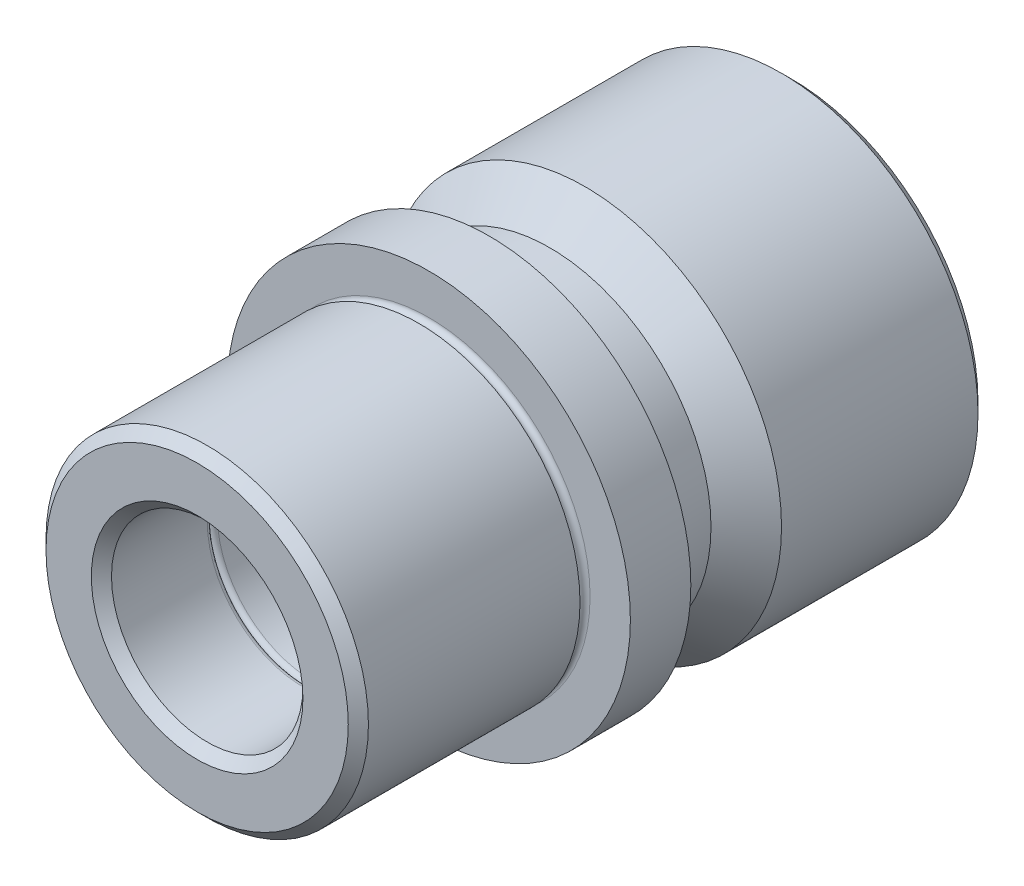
ISO-10303-21;
HEADER;
FILE_DESCRIPTION(('STEP AP214'),'2;1');
FILE_NAME('part.step','',(''),(''),'','','');
FILE_SCHEMA(('AUTOMOTIVE_DESIGN { 1 0 10303 214 1 1 1 1 }'));
ENDSEC;
DATA;
#1=APPLICATION_CONTEXT('core data for automotive mechanical design processes');
#2=APPLICATION_PROTOCOL_DEFINITION('international standard','automotive_design',2000,#1);
#3=PRODUCT_CONTEXT('',#1,'mechanical');
#4=PRODUCT('Part','Part','',(#3));
#5=PRODUCT_RELATED_PRODUCT_CATEGORY('part','',(#4));
#6=PRODUCT_DEFINITION_FORMATION('','',#4);
#7=PRODUCT_DEFINITION_CONTEXT('part definition',#1,'design');
#8=PRODUCT_DEFINITION('design','',#6,#7);
#9=PRODUCT_DEFINITION_SHAPE('','',#8);
#10=(LENGTH_UNIT() NAMED_UNIT(*) SI_UNIT(.MILLI.,.METRE.));
#11=(NAMED_UNIT(*) PLANE_ANGLE_UNIT() SI_UNIT($,.RADIAN.));
#12=(NAMED_UNIT(*) SI_UNIT($,.STERADIAN.) SOLID_ANGLE_UNIT());
#13=UNCERTAINTY_MEASURE_WITH_UNIT(LENGTH_MEASURE(1.E-05),#10,'distance_accuracy_value','');
#14=(GEOMETRIC_REPRESENTATION_CONTEXT(3) GLOBAL_UNCERTAINTY_ASSIGNED_CONTEXT((#13)) GLOBAL_UNIT_ASSIGNED_CONTEXT((#10,
#11,#12)) REPRESENTATION_CONTEXT('',''));
#15=CARTESIAN_POINT('',(0.,0.,0.));
#16=DIRECTION('',(0.,0.,1.));
#17=DIRECTION('',(1.,0.,0.));
#18=AXIS2_PLACEMENT_3D('',#15,#16,#17);
#19=CARTESIAN_POINT('',(0.,0.,-27.5));
#20=DIRECTION('',(0.,0.,1.));
#21=DIRECTION('',(1.,0.,0.));
#22=AXIS2_PLACEMENT_3D('',#19,#20,#21);
#23=TOROIDAL_SURFACE('',#22,10.,0.5);
#24=CARTESIAN_POINT('',(0.,0.,-27.5));
#25=DIRECTION('',(0.,0.,1.));
#26=DIRECTION('',(1.,0.,0.));
#27=AXIS2_PLACEMENT_3D('',#24,#25,#26);
#28=CIRCLE('',#27,9.5);
#29=CARTESIAN_POINT('',(9.5,0.,-27.5));
#30=VERTEX_POINT('',#29);
#31=EDGE_CURVE('E81',#30,#30,#28,.T.);
#32=ORIENTED_EDGE('',*,*,#31,.T.);
#33=EDGE_LOOP('',(#32));
#34=FACE_BOUND('',#33,.T.);
#35=CARTESIAN_POINT('',(0.,0.,-28.));
#36=DIRECTION('',(0.,0.,1.));
#37=DIRECTION('',(1.,0.,0.));
#38=AXIS2_PLACEMENT_3D('',#35,#36,#37);
#39=CIRCLE('',#38,10.);
#40=CARTESIAN_POINT('',(10.,0.,-28.));
#41=VERTEX_POINT('',#40);
#42=EDGE_CURVE('E45',#41,#41,#39,.T.);
#43=ORIENTED_EDGE('',*,*,#42,.F.);
#44=EDGE_LOOP('',(#43));
#45=FACE_BOUND('',#44,.T.);
#46=ADVANCED_FACE('F13',(#34,#45),#23,.T.);
#47=CARTESIAN_POINT('',(0.,0.,-28.5));
#48=DIRECTION('',(0.,0.,1.));
#49=DIRECTION('',(1.,0.,0.));
#50=AXIS2_PLACEMENT_3D('',#47,#48,#49);
#51=TOROIDAL_SURFACE('',#50,10.,0.5);
#52=CARTESIAN_POINT('',(0.,0.,-28.5));
#53=DIRECTION('',(0.,0.,1.));
#54=DIRECTION('',(1.,0.,0.));
#55=AXIS2_PLACEMENT_3D('',#52,#53,#54);
#56=CIRCLE('',#55,9.5);
#57=CARTESIAN_POINT('',(9.5,0.,-28.5));
#58=VERTEX_POINT('',#57);
#59=EDGE_CURVE('E48',#58,#58,#56,.T.);
#60=ORIENTED_EDGE('',*,*,#59,.F.);
#61=EDGE_LOOP('',(#60));
#62=FACE_BOUND('',#61,.T.);
#63=ORIENTED_EDGE('',*,*,#42,.T.);
#64=EDGE_LOOP('',(#63));
#65=FACE_BOUND('',#64,.T.);
#66=ADVANCED_FACE('F113',(#62,#65),#51,.T.);
#67=CARTESIAN_POINT('',(0.,0.,0.));
#68=DIRECTION('',(0.,0.,1.));
#69=DIRECTION('',(1.,0.,0.));
#70=AXIS2_PLACEMENT_3D('',#67,#68,#69);
#71=CYLINDRICAL_SURFACE('',#70,9.5);
#72=CARTESIAN_POINT('',(0.,0.,-58.));
#73=DIRECTION('',(0.,0.,1.));
#74=DIRECTION('',(1.,0.,0.));
#75=AXIS2_PLACEMENT_3D('',#72,#73,#74);
#76=CIRCLE('',#75,9.5);
#77=CARTESIAN_POINT('',(9.5,0.,-58.));
#78=VERTEX_POINT('',#77);
#79=EDGE_CURVE('E36',#78,#78,#76,.F.);
#80=ORIENTED_EDGE('',*,*,#79,.T.);
#81=EDGE_LOOP('',(#80));
#82=FACE_BOUND('',#81,.T.);
#83=ORIENTED_EDGE('',*,*,#59,.T.);
#84=EDGE_LOOP('',(#83));
#85=FACE_BOUND('',#84,.T.);
#86=ADVANCED_FACE('F118',(#82,#85),#71,.F.);
#87=CARTESIAN_POINT('',(0.,0.,-59.));
#88=DIRECTION('',(0.,0.,1.));
#89=DIRECTION('',(1.,0.,0.));
#90=AXIS2_PLACEMENT_3D('',#87,#88,#89);
#91=PLANE('',#90);
#92=CARTESIAN_POINT('',(0.,0.,-59.));
#93=DIRECTION('',(0.,0.,1.));
#94=DIRECTION('',(1.,0.,0.));
#95=AXIS2_PLACEMENT_3D('',#92,#93,#94);
#96=CIRCLE('',#95,10.5);
#97=CARTESIAN_POINT('',(10.5,0.,-59.));
#98=VERTEX_POINT('',#97);
#99=EDGE_CURVE('E39',#98,#98,#96,.T.);
#100=ORIENTED_EDGE('',*,*,#99,.T.);
#101=EDGE_LOOP('',(#100));
#102=FACE_BOUND('',#101,.T.);
#103=CARTESIAN_POINT('',(0.,0.,-59.));
#104=DIRECTION('',(0.,0.,1.));
#105=DIRECTION('',(1.,0.,0.));
#106=AXIS2_PLACEMENT_3D('',#103,#104,#105);
#107=CIRCLE('',#106,18.5);
#108=CARTESIAN_POINT('',(18.5,0.,-59.));
#109=VERTEX_POINT('',#108);
#110=EDGE_CURVE('E42',#109,#109,#107,.F.);
#111=ORIENTED_EDGE('',*,*,#110,.T.);
#112=EDGE_LOOP('',(#111));
#113=FACE_BOUND('',#112,.T.);
#114=ADVANCED_FACE('F185',(#102,#113),#91,.F.);
#115=CARTESIAN_POINT('',(0.,0.,0.));
#116=DIRECTION('',(0.,0.,1.));
#117=DIRECTION('',(1.,0.,0.));
#118=AXIS2_PLACEMENT_3D('',#115,#116,#117);
#119=CYLINDRICAL_SURFACE('',#118,19.5);
#120=CARTESIAN_POINT('',(0.,0.,-58.));
#121=DIRECTION('',(0.,0.,1.));
#122=DIRECTION('',(1.,0.,0.));
#123=AXIS2_PLACEMENT_3D('',#120,#121,#122);
#124=CIRCLE('',#123,19.5);
#125=CARTESIAN_POINT('',(19.5,0.,-58.));
#126=VERTEX_POINT('',#125);
#127=EDGE_CURVE('E33',#126,#126,#124,.T.);
#128=ORIENTED_EDGE('',*,*,#127,.T.);
#129=EDGE_LOOP('',(#128));
#130=FACE_BOUND('',#129,.T.);
#131=CARTESIAN_POINT('',(0.,0.,-38.5));
#132=DIRECTION('',(0.,0.,1.));
#133=DIRECTION('',(1.,0.,0.));
#134=AXIS2_PLACEMENT_3D('',#131,#132,#133);
#135=CIRCLE('',#134,19.5);
#136=CARTESIAN_POINT('',(19.5,0.,-38.5));
#137=VERTEX_POINT('',#136);
#138=EDGE_CURVE('E51',#137,#137,#135,.T.);
#139=ORIENTED_EDGE('',*,*,#138,.F.);
#140=EDGE_LOOP('',(#139));
#141=FACE_BOUND('',#140,.T.);
#142=ADVANCED_FACE('F181',(#130,#141),#119,.T.);
#143=CARTESIAN_POINT('',(0.,0.,-35.));
#144=DIRECTION('',(0.,0.,-1.));
#145=DIRECTION('',(-1.,0.,0.));
#146=AXIS2_PLACEMENT_3D('',#143,#144,#145);
#147=CONICAL_SURFACE('',#146,16.,0.785398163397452);
#148=ORIENTED_EDGE('',*,*,#138,.T.);
#149=EDGE_LOOP('',(#148));
#150=FACE_BOUND('',#149,.T.);
#151=CARTESIAN_POINT('',(0.,0.,-35.));
#152=DIRECTION('',(0.,0.,1.));
#153=DIRECTION('',(1.,0.,0.));
#154=AXIS2_PLACEMENT_3D('',#151,#152,#153);
#155=CIRCLE('',#154,16.);
#156=CARTESIAN_POINT('',(16.,0.,-35.));
#157=VERTEX_POINT('',#156);
#158=EDGE_CURVE('E54',#157,#157,#155,.T.);
#159=ORIENTED_EDGE('',*,*,#158,.F.);
#160=EDGE_LOOP('',(#159));
#161=FACE_BOUND('',#160,.T.);
#162=ADVANCED_FACE('F177',(#150,#161),#147,.T.);
#163=CARTESIAN_POINT('',(0.,0.,0.));
#164=DIRECTION('',(0.,0.,1.));
#165=DIRECTION('',(1.,0.,0.));
#166=AXIS2_PLACEMENT_3D('',#163,#164,#165);
#167=CYLINDRICAL_SURFACE('',#166,16.);
#168=ORIENTED_EDGE('',*,*,#158,.T.);
#169=EDGE_LOOP('',(#168));
#170=FACE_BOUND('',#169,.T.);
#171=CARTESIAN_POINT('',(0.,0.,-29.));
#172=DIRECTION('',(0.,0.,1.));
#173=DIRECTION('',(1.,0.,0.));
#174=AXIS2_PLACEMENT_3D('',#171,#172,#173);
#175=CIRCLE('',#174,16.);
#176=CARTESIAN_POINT('',(16.,0.,-29.));
#177=VERTEX_POINT('',#176);
#178=EDGE_CURVE('E57',#177,#177,#175,.T.);
#179=ORIENTED_EDGE('',*,*,#178,.F.);
#180=EDGE_LOOP('',(#179));
#181=FACE_BOUND('',#180,.T.);
#182=ADVANCED_FACE('F173',(#170,#181),#167,.T.);
#183=CARTESIAN_POINT('',(0.,0.,-29.));
#184=DIRECTION('',(0.,0.,-1.));
#185=DIRECTION('',(-1.,0.,0.));
#186=AXIS2_PLACEMENT_3D('',#183,#184,#185);
#187=PLANE('',#186);
#188=ORIENTED_EDGE('',*,*,#178,.T.);
#189=EDGE_LOOP('',(#188));
#190=FACE_BOUND('',#189,.T.);
#191=CARTESIAN_POINT('',(0.,0.,-29.));
#192=DIRECTION('',(0.,0.,1.));
#193=DIRECTION('',(1.,0.,0.));
#194=AXIS2_PLACEMENT_3D('',#191,#192,#193);
#195=CIRCLE('',#194,20.);
#196=CARTESIAN_POINT('',(20.,0.,-29.));
#197=VERTEX_POINT('',#196);
#198=EDGE_CURVE('E60',#197,#197,#195,.T.);
#199=ORIENTED_EDGE('',*,*,#198,.F.);
#200=EDGE_LOOP('',(#199));
#201=FACE_BOUND('',#200,.T.);
#202=ADVANCED_FACE('F169',(#190,#201),#187,.T.);
#203=CARTESIAN_POINT('',(0.,0.,0.));
#204=DIRECTION('',(0.,0.,1.));
#205=DIRECTION('',(1.,0.,0.));
#206=AXIS2_PLACEMENT_3D('',#203,#204,#205);
#207=CYLINDRICAL_SURFACE('',#206,20.);
#208=ORIENTED_EDGE('',*,*,#198,.T.);
#209=EDGE_LOOP('',(#208));
#210=FACE_BOUND('',#209,.T.);
#211=CARTESIAN_POINT('',(0.,0.,-23.));
#212=DIRECTION('',(0.,0.,1.));
#213=DIRECTION('',(1.,0.,0.));
#214=AXIS2_PLACEMENT_3D('',#211,#212,#213);
#215=CIRCLE('',#214,20.);
#216=CARTESIAN_POINT('',(20.,0.,-23.));
#217=VERTEX_POINT('',#216);
#218=EDGE_CURVE('E63',#217,#217,#215,.T.);
#219=ORIENTED_EDGE('',*,*,#218,.F.);
#220=EDGE_LOOP('',(#219));
#221=FACE_BOUND('',#220,.T.);
#222=ADVANCED_FACE('F165',(#210,#221),#207,.T.);
#223=CARTESIAN_POINT('',(0.,0.,-23.));
#224=DIRECTION('',(0.,0.,1.));
#225=DIRECTION('',(1.,0.,0.));
#226=AXIS2_PLACEMENT_3D('',#223,#224,#225);
#227=PLANE('',#226);
#228=ORIENTED_EDGE('',*,*,#218,.T.);
#229=EDGE_LOOP('',(#228));
#230=FACE_BOUND('',#229,.T.);
#231=CARTESIAN_POINT('',(0.,0.,-23.));
#232=DIRECTION('',(0.,0.,1.));
#233=DIRECTION('',(1.,0.,0.));
#234=AXIS2_PLACEMENT_3D('',#231,#232,#233);
#235=CIRCLE('',#234,16.);
#236=CARTESIAN_POINT('',(16.,0.,-23.));
#237=VERTEX_POINT('',#236);
#238=EDGE_CURVE('E66',#237,#237,#235,.T.);
#239=ORIENTED_EDGE('',*,*,#238,.F.);
#240=EDGE_LOOP('',(#239));
#241=FACE_BOUND('',#240,.T.);
#242=ADVANCED_FACE('F161',(#230,#241),#227,.T.);
#243=CARTESIAN_POINT('',(0.,0.,-22.5));
#244=DIRECTION('',(0.,0.,1.));
#245=DIRECTION('',(1.,0.,0.));
#246=AXIS2_PLACEMENT_3D('',#243,#244,#245);
#247=TOROIDAL_SURFACE('',#246,16.,0.5);
#248=ORIENTED_EDGE('',*,*,#238,.T.);
#249=EDGE_LOOP('',(#248));
#250=FACE_BOUND('',#249,.T.);
#251=CARTESIAN_POINT('',(0.,0.,-22.));
#252=DIRECTION('',(0.,0.,1.));
#253=DIRECTION('',(1.,0.,0.));
#254=AXIS2_PLACEMENT_3D('',#251,#252,#253);
#255=CIRCLE('',#254,16.);
#256=CARTESIAN_POINT('',(16.,0.,-22.));
#257=VERTEX_POINT('',#256);
#258=EDGE_CURVE('E69',#257,#257,#255,.T.);
#259=ORIENTED_EDGE('',*,*,#258,.F.);
#260=EDGE_LOOP('',(#259));
#261=FACE_BOUND('',#260,.T.);
#262=ADVANCED_FACE('F156',(#250,#261),#247,.F.);
#263=CARTESIAN_POINT('',(0.,0.,0.));
#264=DIRECTION('',(0.,0.,1.));
#265=DIRECTION('',(1.,0.,0.));
#266=AXIS2_PLACEMENT_3D('',#263,#264,#265);
#267=CYLINDRICAL_SURFACE('',#266,16.);
#268=CARTESIAN_POINT('',(0.,0.,-1.));
#269=DIRECTION('',(0.,0.,1.));
#270=DIRECTION('',(1.,0.,0.));
#271=AXIS2_PLACEMENT_3D('',#268,#269,#270);
#272=CIRCLE('',#271,16.);
#273=CARTESIAN_POINT('',(16.,0.,-1.));
#274=VERTEX_POINT('',#273);
#275=EDGE_CURVE('E8',#274,#274,#272,.F.);
#276=ORIENTED_EDGE('',*,*,#275,.T.);
#277=EDGE_LOOP('',(#276));
#278=FACE_BOUND('',#277,.T.);
#279=ORIENTED_EDGE('',*,*,#258,.T.);
#280=EDGE_LOOP('',(#279));
#281=FACE_BOUND('',#280,.T.);
#282=ADVANCED_FACE('F149',(#278,#281),#267,.T.);
#283=CARTESIAN_POINT('',(0.,0.,0.));
#284=DIRECTION('',(0.,0.,1.));
#285=DIRECTION('',(1.,0.,0.));
#286=AXIS2_PLACEMENT_3D('',#283,#284,#285);
#287=PLANE('',#286);
#288=CARTESIAN_POINT('',(0.,0.,0.));
#289=DIRECTION('',(0.,0.,1.));
#290=DIRECTION('',(1.,0.,0.));
#291=AXIS2_PLACEMENT_3D('',#288,#289,#290);
#292=CIRCLE('',#291,10.5);
#293=CARTESIAN_POINT('',(10.5,0.,0.));
#294=VERTEX_POINT('',#293);
#295=EDGE_CURVE('E20',#294,#294,#292,.F.);
#296=ORIENTED_EDGE('',*,*,#295,.T.);
#297=EDGE_LOOP('',(#296));
#298=FACE_BOUND('',#297,.T.);
#299=CARTESIAN_POINT('',(0.,0.,0.));
#300=DIRECTION('',(0.,0.,1.));
#301=DIRECTION('',(1.,0.,0.));
#302=AXIS2_PLACEMENT_3D('',#299,#300,#301);
#303=CIRCLE('',#302,15.);
#304=CARTESIAN_POINT('',(15.,0.,0.));
#305=VERTEX_POINT('',#304);
#306=EDGE_CURVE('E24',#305,#305,#303,.T.);
#307=ORIENTED_EDGE('',*,*,#306,.T.);
#308=EDGE_LOOP('',(#307));
#309=FACE_BOUND('',#308,.T.);
#310=ADVANCED_FACE('F109',(#298,#309),#287,.T.);
#311=CARTESIAN_POINT('',(0.,0.,0.));
#312=DIRECTION('',(0.,0.,1.));
#313=DIRECTION('',(1.,0.,0.));
#314=AXIS2_PLACEMENT_3D('',#311,#312,#313);
#315=CYLINDRICAL_SURFACE('',#314,9.5);
#316=CARTESIAN_POINT('',(0.,0.,-1.));
#317=DIRECTION('',(0.,0.,1.));
#318=DIRECTION('',(1.,0.,0.));
#319=AXIS2_PLACEMENT_3D('',#316,#317,#318);
#320=CIRCLE('',#319,9.5);
#321=CARTESIAN_POINT('',(9.5,0.,-1.));
#322=VERTEX_POINT('',#321);
#323=EDGE_CURVE('E28',#322,#322,#320,.T.);
#324=ORIENTED_EDGE('',*,*,#323,.T.);
#325=EDGE_LOOP('',(#324));
#326=FACE_BOUND('',#325,.T.);
#327=CARTESIAN_POINT('',(0.,0.,-10.5));
#328=DIRECTION('',(0.,0.,1.));
#329=DIRECTION('',(1.,0.,0.));
#330=AXIS2_PLACEMENT_3D('',#327,#328,#329);
#331=CIRCLE('',#330,9.5);
#332=CARTESIAN_POINT('',(9.5,0.,-10.5));
#333=VERTEX_POINT('',#332);
#334=EDGE_CURVE('E72',#333,#333,#331,.T.);
#335=ORIENTED_EDGE('',*,*,#334,.F.);
#336=EDGE_LOOP('',(#335));
#337=FACE_BOUND('',#336,.T.);
#338=ADVANCED_FACE('F102',(#326,#337),#315,.F.);
#339=CARTESIAN_POINT('',(0.,0.,-10.5));
#340=DIRECTION('',(0.,0.,1.));
#341=DIRECTION('',(1.,0.,0.));
#342=AXIS2_PLACEMENT_3D('',#339,#340,#341);
#343=TOROIDAL_SURFACE('',#342,10.,0.5);
#344=ORIENTED_EDGE('',*,*,#334,.T.);
#345=EDGE_LOOP('',(#344));
#346=FACE_BOUND('',#345,.T.);
#347=CARTESIAN_POINT('',(0.,0.,-11.));
#348=DIRECTION('',(0.,0.,1.));
#349=DIRECTION('',(1.,0.,0.));
#350=AXIS2_PLACEMENT_3D('',#347,#348,#349);
#351=CIRCLE('',#350,10.);
#352=CARTESIAN_POINT('',(10.,0.,-11.));
#353=VERTEX_POINT('',#352);
#354=EDGE_CURVE('E75',#353,#353,#351,.T.);
#355=ORIENTED_EDGE('',*,*,#354,.F.);
#356=EDGE_LOOP('',(#355));
#357=FACE_BOUND('',#356,.T.);
#358=ADVANCED_FACE('F97',(#346,#357),#343,.T.);
#359=CARTESIAN_POINT('',(0.,0.,-11.5));
#360=DIRECTION('',(0.,0.,1.));
#361=DIRECTION('',(1.,0.,0.));
#362=AXIS2_PLACEMENT_3D('',#359,#360,#361);
#363=TOROIDAL_SURFACE('',#362,10.,0.5);
#364=CARTESIAN_POINT('',(0.,0.,-11.5));
#365=DIRECTION('',(0.,0.,1.));
#366=DIRECTION('',(1.,0.,0.));
#367=AXIS2_PLACEMENT_3D('',#364,#365,#366);
#368=CIRCLE('',#367,9.5);
#369=CARTESIAN_POINT('',(9.5,0.,-11.5));
#370=VERTEX_POINT('',#369);
#371=EDGE_CURVE('E78',#370,#370,#368,.T.);
#372=ORIENTED_EDGE('',*,*,#371,.F.);
#373=EDGE_LOOP('',(#372));
#374=FACE_BOUND('',#373,.T.);
#375=ORIENTED_EDGE('',*,*,#354,.T.);
#376=EDGE_LOOP('',(#375));
#377=FACE_BOUND('',#376,.T.);
#378=ADVANCED_FACE('F91',(#374,#377),#363,.T.);
#379=CARTESIAN_POINT('',(0.,0.,0.));
#380=DIRECTION('',(0.,0.,1.));
#381=DIRECTION('',(1.,0.,0.));
#382=AXIS2_PLACEMENT_3D('',#379,#380,#381);
#383=CYLINDRICAL_SURFACE('',#382,9.5);
#384=ORIENTED_EDGE('',*,*,#31,.F.);
#385=EDGE_LOOP('',(#384));
#386=FACE_BOUND('',#385,.T.);
#387=ORIENTED_EDGE('',*,*,#371,.T.);
#388=EDGE_LOOP('',(#387));
#389=FACE_BOUND('',#388,.T.);
#390=ADVANCED_FACE('F87',(#386,#389),#383,.F.);
#391=CARTESIAN_POINT('',(0.,0.,-59.));
#392=DIRECTION('',(0.,0.,-1.));
#393=DIRECTION('',(-1.,0.,0.));
#394=AXIS2_PLACEMENT_3D('',#391,#392,#393);
#395=CONICAL_SURFACE('',#394,10.5,0.785398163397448);
#396=ORIENTED_EDGE('',*,*,#79,.F.);
#397=EDGE_LOOP('',(#396));
#398=FACE_BOUND('',#397,.T.);
#399=ORIENTED_EDGE('',*,*,#99,.F.);
#400=EDGE_LOOP('',(#399));
#401=FACE_BOUND('',#400,.T.);
#402=ADVANCED_FACE('F90',(#398,#401),#395,.F.);
#403=CARTESIAN_POINT('',(0.,0.,-58.));
#404=DIRECTION('',(0.,0.,1.));
#405=DIRECTION('',(1.,0.,0.));
#406=AXIS2_PLACEMENT_3D('',#403,#404,#405);
#407=CONICAL_SURFACE('',#406,19.5,0.785398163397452);
#408=ORIENTED_EDGE('',*,*,#110,.F.);
#409=EDGE_LOOP('',(#408));
#410=FACE_BOUND('',#409,.T.);
#411=ORIENTED_EDGE('',*,*,#127,.F.);
#412=EDGE_LOOP('',(#411));
#413=FACE_BOUND('',#412,.T.);
#414=ADVANCED_FACE('F125',(#410,#413),#407,.T.);
#415=CARTESIAN_POINT('',(0.,0.,-1.));
#416=DIRECTION('',(0.,0.,1.));
#417=DIRECTION('',(1.,0.,0.));
#418=AXIS2_PLACEMENT_3D('',#415,#416,#417);
#419=CONICAL_SURFACE('',#418,9.5,0.785398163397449);
#420=ORIENTED_EDGE('',*,*,#295,.F.);
#421=EDGE_LOOP('',(#420));
#422=FACE_BOUND('',#421,.T.);
#423=ORIENTED_EDGE('',*,*,#323,.F.);
#424=EDGE_LOOP('',(#423));
#425=FACE_BOUND('',#424,.T.);
#426=ADVANCED_FACE('F128',(#422,#425),#419,.F.);
#427=CARTESIAN_POINT('',(0.,0.,0.));
#428=DIRECTION('',(0.,0.,-1.));
#429=DIRECTION('',(-1.,0.,0.));
#430=AXIS2_PLACEMENT_3D('',#427,#428,#429);
#431=CONICAL_SURFACE('',#430,15.,0.785398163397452);
#432=ORIENTED_EDGE('',*,*,#275,.F.);
#433=EDGE_LOOP('',(#432));
#434=FACE_BOUND('',#433,.T.);
#435=ORIENTED_EDGE('',*,*,#306,.F.);
#436=EDGE_LOOP('',(#435));
#437=FACE_BOUND('',#436,.T.);
#438=ADVANCED_FACE('F15',(#434,#437),#431,.T.);
#439=CLOSED_SHELL('',(#46,#66,#86,#114,#142,#162,#182,#202,#222,#242,#262,#282,#310,#338,#358,
#378,#390,#402,#414,#426,#438));
#440=MANIFOLD_SOLID_BREP('B1',#439);
#441=ADVANCED_BREP_SHAPE_REPRESENTATION('',(#18,#440),#14);
#442=SHAPE_DEFINITION_REPRESENTATION(#9,#441);
ENDSEC;
END-ISO-10303-21;
